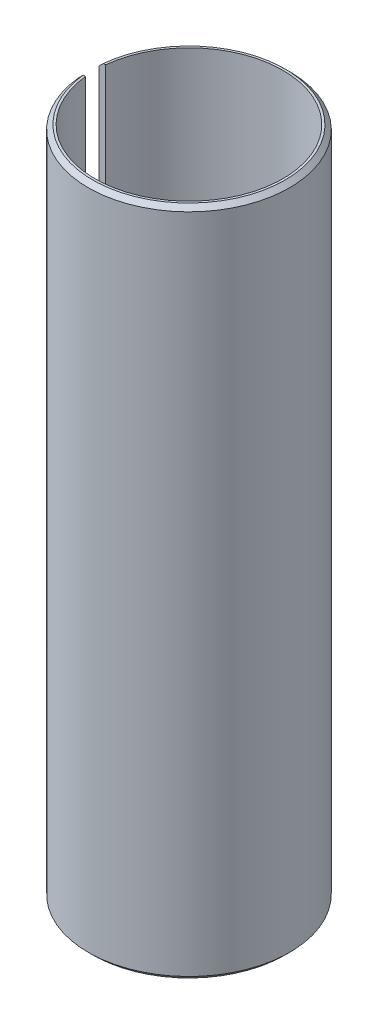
ISO-10303-21;
HEADER;
FILE_DESCRIPTION(('STEP AP214'),'2;1');
FILE_NAME('part.step','',(''),(''),'','','');
FILE_SCHEMA(('AUTOMOTIVE_DESIGN { 1 0 10303 214 1 1 1 1 }'));
ENDSEC;
DATA;
#1=APPLICATION_CONTEXT('core data for automotive mechanical design processes');
#2=APPLICATION_PROTOCOL_DEFINITION('international standard','automotive_design',2000,#1);
#3=PRODUCT_CONTEXT('',#1,'mechanical');
#4=PRODUCT('Part','Part','',(#3));
#5=PRODUCT_RELATED_PRODUCT_CATEGORY('part','',(#4));
#6=PRODUCT_DEFINITION_FORMATION('','',#4);
#7=PRODUCT_DEFINITION_CONTEXT('part definition',#1,'design');
#8=PRODUCT_DEFINITION('design','',#6,#7);
#9=PRODUCT_DEFINITION_SHAPE('','',#8);
#10=(LENGTH_UNIT() NAMED_UNIT(*) SI_UNIT(.MILLI.,.METRE.));
#11=(NAMED_UNIT(*) PLANE_ANGLE_UNIT() SI_UNIT($,.RADIAN.));
#12=(NAMED_UNIT(*) SI_UNIT($,.STERADIAN.) SOLID_ANGLE_UNIT());
#13=UNCERTAINTY_MEASURE_WITH_UNIT(LENGTH_MEASURE(1.E-05),#10,'distance_accuracy_value','');
#14=(GEOMETRIC_REPRESENTATION_CONTEXT(3) GLOBAL_UNCERTAINTY_ASSIGNED_CONTEXT((#13)) GLOBAL_UNIT_ASSIGNED_CONTEXT((#10,
#11,#12)) REPRESENTATION_CONTEXT('',''));
#15=CARTESIAN_POINT('',(0.,0.,0.));
#16=DIRECTION('',(0.,0.,1.));
#17=DIRECTION('',(1.,0.,0.));
#18=AXIS2_PLACEMENT_3D('',#15,#16,#17);
#19=CARTESIAN_POINT('',(2.8,10.,0.));
#20=DIRECTION('',(0.,-1.,0.));
#21=DIRECTION('',(0.,0.,-1.));
#22=AXIS2_PLACEMENT_3D('',#19,#20,#21);
#23=PLANE('',#22);
#24=CARTESIAN_POINT('',(0.,10.,0.));
#25=DIRECTION('',(0.,-1.,0.));
#26=DIRECTION('',(0.,0.,-1.));
#27=AXIS2_PLACEMENT_3D('',#24,#25,#26);
#28=CIRCLE('',#27,2.86666666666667);
#29=CARTESIAN_POINT('',(-2.85092577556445,10.,0.3));
#30=VERTEX_POINT('',#29);
#31=CARTESIAN_POINT('',(-2.85092577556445,10.,-0.3));
#32=VERTEX_POINT('',#31);
#33=EDGE_CURVE('E109',#30,#32,#28,.F.);
#34=ORIENTED_EDGE('',*,*,#33,.T.);
#35=DIRECTION('',(-1.,0.,0.));
#36=VECTOR('',#35,1.);
#37=CARTESIAN_POINT('',(0.,10.,-0.3));
#38=LINE('',#37,#36);
#39=CARTESIAN_POINT('',(-2.78388218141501,10.,-0.3));
#40=VERTEX_POINT('',#39);
#41=EDGE_CURVE('E161',#40,#32,#38,.T.);
#42=ORIENTED_EDGE('',*,*,#41,.F.);
#43=CARTESIAN_POINT('',(0.,10.,0.));
#44=DIRECTION('',(0.,1.,0.));
#45=DIRECTION('',(0.,0.,1.));
#46=AXIS2_PLACEMENT_3D('',#43,#44,#45);
#47=CIRCLE('',#46,2.8);
#48=CARTESIAN_POINT('',(-2.78388218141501,10.,0.3));
#49=VERTEX_POINT('',#48);
#50=EDGE_CURVE('E105',#49,#40,#47,.T.);
#51=ORIENTED_EDGE('',*,*,#50,.F.);
#52=DIRECTION('',(1.,0.,0.));
#53=VECTOR('',#52,1.);
#54=CARTESIAN_POINT('',(0.,10.,0.3));
#55=LINE('',#54,#53);
#56=EDGE_CURVE('E96',#30,#49,#55,.T.);
#57=ORIENTED_EDGE('',*,*,#56,.F.);
#58=EDGE_LOOP('',(#34,#42,#51,#57));
#59=FACE_BOUND('',#58,.T.);
#60=ADVANCED_FACE('F33',(#59),#23,.F.);
#61=CARTESIAN_POINT('',(0.,10.,0.));
#62=DIRECTION('',(0.,1.,0.));
#63=DIRECTION('',(0.,0.,1.));
#64=AXIS2_PLACEMENT_3D('',#61,#62,#63);
#65=CYLINDRICAL_SURFACE('',#64,3.);
#66=CARTESIAN_POINT('',(0.,-9.86666666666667,0.));
#67=DIRECTION('',(0.,1.,0.));
#68=DIRECTION('',(0.,0.,1.));
#69=AXIS2_PLACEMENT_3D('',#66,#67,#68);
#70=CIRCLE('',#69,3.);
#71=CARTESIAN_POINT('',(-2.98496231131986,-9.86666666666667,0.3));
#72=VERTEX_POINT('',#71);
#73=CARTESIAN_POINT('',(-2.98496231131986,-9.86666666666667,-0.3));
#74=VERTEX_POINT('',#73);
#75=EDGE_CURVE('E112',#72,#74,#70,.T.);
#76=ORIENTED_EDGE('',*,*,#75,.T.);
#77=DIRECTION('',(0.,1.,0.));
#78=VECTOR('',#77,1.);
#79=CARTESIAN_POINT('',(-2.98496231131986,10.,-0.3));
#80=LINE('',#79,#78);
#81=CARTESIAN_POINT('',(-2.98496231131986,9.86666666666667,-0.3));
#82=VERTEX_POINT('',#81);
#83=EDGE_CURVE('E51',#74,#82,#80,.T.);
#84=ORIENTED_EDGE('',*,*,#83,.T.);
#85=CARTESIAN_POINT('',(0.,9.86666666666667,0.));
#86=DIRECTION('',(0.,-1.,0.));
#87=DIRECTION('',(0.,0.,-1.));
#88=AXIS2_PLACEMENT_3D('',#85,#86,#87);
#89=CIRCLE('',#88,3.);
#90=CARTESIAN_POINT('',(-2.98496231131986,9.86666666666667,0.3));
#91=VERTEX_POINT('',#90);
#92=EDGE_CURVE('E118',#82,#91,#89,.T.);
#93=ORIENTED_EDGE('',*,*,#92,.T.);
#94=DIRECTION('',(0.,1.,0.));
#95=VECTOR('',#94,1.);
#96=CARTESIAN_POINT('',(-2.98496231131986,10.,0.3));
#97=LINE('',#96,#95);
#98=EDGE_CURVE('E142',#91,#72,#97,.F.);
#99=ORIENTED_EDGE('',*,*,#98,.T.);
#100=EDGE_LOOP('',(#76,#84,#93,#99));
#101=FACE_BOUND('',#100,.T.);
#102=ADVANCED_FACE('F167',(#101),#65,.T.);
#103=CARTESIAN_POINT('',(3.,-10.,0.));
#104=DIRECTION('',(0.,1.,0.));
#105=DIRECTION('',(0.,0.,1.));
#106=AXIS2_PLACEMENT_3D('',#103,#104,#105);
#107=PLANE('',#106);
#108=CARTESIAN_POINT('',(0.,-10.,0.));
#109=DIRECTION('',(0.,1.,0.));
#110=DIRECTION('',(0.,0.,1.));
#111=AXIS2_PLACEMENT_3D('',#108,#109,#110);
#112=CIRCLE('',#111,2.8);
#113=CARTESIAN_POINT('',(-2.78388218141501,-10.,0.3));
#114=VERTEX_POINT('',#113);
#115=CARTESIAN_POINT('',(-2.78388218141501,-10.,-0.3));
#116=VERTEX_POINT('',#115);
#117=EDGE_CURVE('E103',#114,#116,#112,.T.);
#118=ORIENTED_EDGE('',*,*,#117,.T.);
#119=DIRECTION('',(-1.,0.,0.));
#120=VECTOR('',#119,1.);
#121=CARTESIAN_POINT('',(0.,-10.,-0.3));
#122=LINE('',#121,#120);
#123=CARTESIAN_POINT('',(-2.85092577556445,-10.,-0.3));
#124=VERTEX_POINT('',#123);
#125=EDGE_CURVE('E87',#116,#124,#122,.T.);
#126=ORIENTED_EDGE('',*,*,#125,.T.);
#127=CARTESIAN_POINT('',(0.,-10.,0.));
#128=DIRECTION('',(0.,1.,0.));
#129=DIRECTION('',(0.,0.,1.));
#130=AXIS2_PLACEMENT_3D('',#127,#128,#129);
#131=CIRCLE('',#130,2.86666666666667);
#132=CARTESIAN_POINT('',(-2.85092577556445,-10.,0.3));
#133=VERTEX_POINT('',#132);
#134=EDGE_CURVE('E121',#124,#133,#131,.F.);
#135=ORIENTED_EDGE('',*,*,#134,.T.);
#136=DIRECTION('',(1.,0.,0.));
#137=VECTOR('',#136,1.);
#138=CARTESIAN_POINT('',(0.,-10.,0.3));
#139=LINE('',#138,#137);
#140=EDGE_CURVE('E59',#133,#114,#139,.T.);
#141=ORIENTED_EDGE('',*,*,#140,.T.);
#142=EDGE_LOOP('',(#118,#126,#135,#141));
#143=FACE_BOUND('',#142,.T.);
#144=ADVANCED_FACE('F108',(#143),#107,.F.);
#145=CARTESIAN_POINT('',(0.,10.,0.));
#146=DIRECTION('',(0.,1.,0.));
#147=DIRECTION('',(0.,0.,1.));
#148=AXIS2_PLACEMENT_3D('',#145,#146,#147);
#149=CYLINDRICAL_SURFACE('',#148,2.8);
#150=ORIENTED_EDGE('',*,*,#50,.T.);
#151=DIRECTION('',(0.,1.,0.));
#152=VECTOR('',#151,1.);
#153=CARTESIAN_POINT('',(-2.78388218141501,10.,-0.3));
#154=LINE('',#153,#152);
#155=EDGE_CURVE('E90',#40,#116,#154,.F.);
#156=ORIENTED_EDGE('',*,*,#155,.T.);
#157=ORIENTED_EDGE('',*,*,#117,.F.);
#158=DIRECTION('',(0.,1.,0.));
#159=VECTOR('',#158,1.);
#160=CARTESIAN_POINT('',(-2.78388218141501,10.,0.3));
#161=LINE('',#160,#159);
#162=EDGE_CURVE('E141',#114,#49,#161,.T.);
#163=ORIENTED_EDGE('',*,*,#162,.T.);
#164=EDGE_LOOP('',(#150,#156,#157,#163));
#165=FACE_BOUND('',#164,.T.);
#166=ADVANCED_FACE('F101',(#165),#149,.F.);
#167=CARTESIAN_POINT('',(0.,10.,0.));
#168=DIRECTION('',(0.,-1.,0.));
#169=DIRECTION('',(0.,0.,-1.));
#170=AXIS2_PLACEMENT_3D('',#167,#168,#169);
#171=CONICAL_SURFACE('',#170,2.86666666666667,0.785398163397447);
#172=CARTESIAN_POINT('',(-0.42228895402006,12.3486628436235,-0.3));
#173=CARTESIAN_POINT('',(-0.441919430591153,12.3326487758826,-0.3));
#174=CARTESIAN_POINT('',(-0.461375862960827,12.3164251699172,-0.3));
#175=CARTESIAN_POINT('',(-0.500010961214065,12.2836541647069,-0.3));
#176=CARTESIAN_POINT('',(-0.519189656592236,12.2671068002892,-0.3));
#177=CARTESIAN_POINT('',(-0.576410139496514,12.2171260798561,-0.3));
#178=CARTESIAN_POINT('',(-0.614147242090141,12.1833450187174,-0.3));
#179=CARTESIAN_POINT('',(-0.689110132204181,12.1152479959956,-0.3));
#180=CARTESIAN_POINT('',(-0.726336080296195,12.0809322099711,-0.3));
#181=CARTESIAN_POINT('',(-0.800460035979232,12.0119419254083,-0.3));
#182=CARTESIAN_POINT('',(-0.837358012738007,11.9772673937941,-0.3));
#183=CARTESIAN_POINT('',(-0.954590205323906,11.8663928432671,-0.3));
#184=CARTESIAN_POINT('',(-1.0345040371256,11.7897491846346,-0.3));
#185=CARTESIAN_POINT('',(-1.193801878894,11.6359127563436,-0.3));
#186=CARTESIAN_POINT('',(-1.27318587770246,11.5587199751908,-0.3));
#187=CARTESIAN_POINT('',(-1.51088596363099,11.3266798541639,-0.3));
#188=CARTESIAN_POINT('',(-1.66875058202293,11.1713703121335,-0.3));
#189=CARTESIAN_POINT('',(-1.98409000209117,10.8601736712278,-0.3));
#190=CARTESIAN_POINT('',(-2.14156452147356,10.704286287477,-0.3));
#191=CARTESIAN_POINT('',(-2.45624930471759,10.3922494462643,-0.3));
#192=CARTESIAN_POINT('',(-2.61345957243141,10.2360999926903,-0.3));
#193=CARTESIAN_POINT('',(-2.96362304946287,9.88796979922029,-0.3));
#194=CARTESIAN_POINT('',(-3.15653859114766,9.69595120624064,-0.3));
#195=CARTESIAN_POINT('',(-3.54224247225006,9.31178418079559,-0.3));
#196=CARTESIAN_POINT('',(-3.73503081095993,9.11963574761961,-0.3));
#197=CARTESIAN_POINT('',(-4.12036705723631,8.7354188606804,-0.3));
#198=CARTESIAN_POINT('',(-4.31291503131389,8.54335047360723,-0.3));
#199=CARTESIAN_POINT('',(-4.69795458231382,8.15915946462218,-0.3));
#200=CARTESIAN_POINT('',(-4.89044615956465,7.96703684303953,-0.3));
#201=CARTESIAN_POINT('',(-5.08292236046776,7.7748988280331,-0.3));
#202=B_SPLINE_CURVE_WITH_KNOTS('',3,(#172,#173,#174,#175,#176,#177,#178,#179,#180,#181,#182,
#183,#184,#185,#186,#187,#188,#189,#190,#191,#192,#193,#194,#195,#196,#197,#198,#199,#200,#201),
.UNSPECIFIED.,.F.,.F.,(4,2,2,2,2,2,2,2,2,2,2,2,2,2,4),(0.,0.0759967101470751,0.151985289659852,
0.30391986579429,0.455805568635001,0.607705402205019,0.939879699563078,1.27206097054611,
1.93642167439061,2.60117129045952,3.26591113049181,4.08248191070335,4.89905719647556,
5.71495233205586,6.53084261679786),.UNSPECIFIED.);
#203=EDGE_CURVE('E106',#32,#82,#202,.T.);
#204=ORIENTED_EDGE('',*,*,#203,.F.);
#205=ORIENTED_EDGE('',*,*,#33,.F.);
#206=CARTESIAN_POINT('',(-5.08292236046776,7.7748988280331,0.3));
#207=CARTESIAN_POINT('',(-4.89035715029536,7.96712555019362,0.3));
#208=CARTESIAN_POINT('',(-4.69777665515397,8.15933697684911,0.3));
#209=CARTESIAN_POINT('',(-4.3125646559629,8.54370009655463,0.3));
#210=CARTESIAN_POINT('',(-4.11993315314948,8.73585179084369,0.3));
#211=CARTESIAN_POINT('',(-3.7346019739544,9.12006305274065,0.3));
#212=CARTESIAN_POINT('',(-3.54190230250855,9.31212262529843,0.3));
#213=CARTESIAN_POINT('',(-3.15637139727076,9.69611810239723,0.3));
#214=CARTESIAN_POINT('',(-2.96354016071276,9.88805400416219,0.3));
#215=CARTESIAN_POINT('',(-2.67411138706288,10.1757994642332,0.3));
#216=CARTESIAN_POINT('',(-2.57759866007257,10.2716943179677,0.3));
#217=CARTESIAN_POINT('',(-2.3844941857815,10.4634027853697,0.3));
#218=CARTESIAN_POINT('',(-2.28790243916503,10.5592163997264,0.3));
#219=CARTESIAN_POINT('',(-2.09461098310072,10.7507218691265,0.3));
#220=CARTESIAN_POINT('',(-1.99791128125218,10.8464137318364,0.3));
#221=CARTESIAN_POINT('',(-1.80433481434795,11.0376241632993,0.3));
#222=CARTESIAN_POINT('',(-1.70745804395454,11.1331427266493,0.3));
#223=CARTESIAN_POINT('',(-1.51340424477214,11.3239192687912,0.3));
#224=CARTESIAN_POINT('',(-1.4162271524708,11.4191771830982,0.3));
#225=CARTESIAN_POINT('',(-1.2700887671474,11.5616717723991,0.3));
#226=CARTESIAN_POINT('',(-1.22131640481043,11.6091021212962,0.3));
#227=CARTESIAN_POINT('',(-1.12359047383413,11.70377913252,0.3));
#228=CARTESIAN_POINT('',(-1.07463689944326,11.7510257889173,0.3));
#229=CARTESIAN_POINT('',(-0.976450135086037,11.8452633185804,0.3));
#230=CARTESIAN_POINT('',(-0.927216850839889,11.8922540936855,0.3));
#231=CARTESIAN_POINT('',(-0.828353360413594,11.9858092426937,0.3));
#232=CARTESIAN_POINT('',(-0.778723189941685,12.0323736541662,0.3));
#233=CARTESIAN_POINT('',(-0.703764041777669,12.1016864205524,0.3));
#234=CARTESIAN_POINT('',(-0.678686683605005,12.1247064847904,0.3));
#235=CARTESIAN_POINT('',(-0.628304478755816,12.1704940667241,0.3));
#236=CARTESIAN_POINT('',(-0.602999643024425,12.1932615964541,0.3));
#237=CARTESIAN_POINT('',(-0.552074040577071,12.2384591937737,0.3));
#238=CARTESIAN_POINT('',(-0.526453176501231,12.2608891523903,0.3));
#239=CARTESIAN_POINT('',(-0.474751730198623,12.3052204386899,0.3));
#240=CARTESIAN_POINT('',(-0.448671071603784,12.327121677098,0.3));
#241=CARTESIAN_POINT('',(-0.42228895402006,12.3486628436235,0.3));
#242=B_SPLINE_CURVE_WITH_KNOTS('',3,(#206,#207,#208,#209,#210,#211,#212,#213,#214,#215,#216,
#217,#218,#219,#220,#221,#222,#223,#224,#225,#226,#227,#228,#229,#230,#231,#232,#233,#234,#235,
#236,#237,#238,#239,#240,#241),.UNSPECIFIED.,.F.,.F.,(4,2,2,2,2,2,2,2,2,2,2,2,2,2,2,2,2,4),(0.,
0.816267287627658,1.63251633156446,2.4487150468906,3.26493148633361,3.67309167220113,
4.0812483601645,4.48937793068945,4.89752001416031,5.30575529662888,5.50985161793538,
5.71395447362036,5.9181307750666,6.1222889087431,6.22441092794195,6.32652805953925,
6.4286774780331,6.53084402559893),.UNSPECIFIED.);
#243=EDGE_CURVE('E135',#91,#30,#242,.T.);
#244=ORIENTED_EDGE('',*,*,#243,.F.);
#245=ORIENTED_EDGE('',*,*,#92,.F.);
#246=EDGE_LOOP('',(#204,#205,#244,#245));
#247=FACE_BOUND('',#246,.T.);
#248=ADVANCED_FACE('F145',(#247),#171,.T.);
#249=CARTESIAN_POINT('',(0.,-9.86666666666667,0.));
#250=DIRECTION('',(0.,1.,0.));
#251=DIRECTION('',(0.,0.,1.));
#252=AXIS2_PLACEMENT_3D('',#249,#250,#251);
#253=CONICAL_SURFACE('',#252,3.,0.78539816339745);
#254=CARTESIAN_POINT('',(-5.08292236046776,-7.77489882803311,-0.3));
#255=CARTESIAN_POINT('',(-4.89035715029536,-7.96712555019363,-0.3));
#256=CARTESIAN_POINT('',(-4.69777665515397,-8.15933697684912,-0.3));
#257=CARTESIAN_POINT('',(-4.3125646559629,-8.54370009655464,-0.3));
#258=CARTESIAN_POINT('',(-4.11993315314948,-8.73585179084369,-0.3));
#259=CARTESIAN_POINT('',(-3.7346019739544,-9.12006305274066,-0.3));
#260=CARTESIAN_POINT('',(-3.54190230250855,-9.31212262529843,-0.3));
#261=CARTESIAN_POINT('',(-3.15637139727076,-9.69611810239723,-0.3));
#262=CARTESIAN_POINT('',(-2.96354016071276,-9.88805400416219,-0.3));
#263=CARTESIAN_POINT('',(-2.67411138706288,-10.1757994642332,-0.3));
#264=CARTESIAN_POINT('',(-2.57759866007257,-10.2716943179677,-0.3));
#265=CARTESIAN_POINT('',(-2.38449418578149,-10.4634027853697,-0.3));
#266=CARTESIAN_POINT('',(-2.28790243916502,-10.5592163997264,-0.3));
#267=CARTESIAN_POINT('',(-2.09461098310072,-10.7507218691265,-0.3));
#268=CARTESIAN_POINT('',(-1.99791128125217,-10.8464137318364,-0.3));
#269=CARTESIAN_POINT('',(-1.80433481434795,-11.0376241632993,-0.3));
#270=CARTESIAN_POINT('',(-1.70745804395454,-11.1331427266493,-0.3));
#271=CARTESIAN_POINT('',(-1.51340424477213,-11.3239192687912,-0.3));
#272=CARTESIAN_POINT('',(-1.4162271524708,-11.4191771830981,-0.3));
#273=CARTESIAN_POINT('',(-1.2700887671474,-11.5616717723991,-0.3));
#274=CARTESIAN_POINT('',(-1.22131640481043,-11.6091021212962,-0.3));
#275=CARTESIAN_POINT('',(-1.12359047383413,-11.70377913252,-0.3));
#276=CARTESIAN_POINT('',(-1.07463689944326,-11.7510257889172,-0.3));
#277=CARTESIAN_POINT('',(-0.976450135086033,-11.8452633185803,-0.3));
#278=CARTESIAN_POINT('',(-0.927216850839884,-11.8922540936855,-0.3));
#279=CARTESIAN_POINT('',(-0.828353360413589,-11.9858092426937,-0.3));
#280=CARTESIAN_POINT('',(-0.778723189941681,-12.0323736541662,-0.3));
#281=CARTESIAN_POINT('',(-0.703764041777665,-12.1016864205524,-0.3));
#282=CARTESIAN_POINT('',(-0.678686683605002,-12.1247064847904,-0.3));
#283=CARTESIAN_POINT('',(-0.628304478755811,-12.1704940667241,-0.3));
#284=CARTESIAN_POINT('',(-0.60299964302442,-12.1932615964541,-0.3));
#285=CARTESIAN_POINT('',(-0.552074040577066,-12.2384591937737,-0.3));
#286=CARTESIAN_POINT('',(-0.526453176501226,-12.2608891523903,-0.3));
#287=CARTESIAN_POINT('',(-0.474751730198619,-12.3052204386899,-0.3));
#288=CARTESIAN_POINT('',(-0.44867107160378,-12.327121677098,-0.3));
#289=CARTESIAN_POINT('',(-0.422288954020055,-12.3486628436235,-0.3));
#290=B_SPLINE_CURVE_WITH_KNOTS('',3,(#254,#255,#256,#257,#258,#259,#260,#261,#262,#263,#264,
#265,#266,#267,#268,#269,#270,#271,#272,#273,#274,#275,#276,#277,#278,#279,#280,#281,#282,#283,
#284,#285,#286,#287,#288,#289),.UNSPECIFIED.,.F.,.F.,(4,2,2,2,2,2,2,2,2,2,2,2,2,2,2,2,2,4),(0.,
0.816267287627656,1.63251633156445,2.4487150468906,3.2649314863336,3.67309167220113,
4.08124836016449,4.48937793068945,4.8975200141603,5.30575529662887,5.50985161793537,
5.71395447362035,5.91813077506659,6.12228890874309,6.22441092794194,6.32652805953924,
6.42867747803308,6.53084402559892),.UNSPECIFIED.);
#291=EDGE_CURVE('E11',#74,#124,#290,.T.);
#292=ORIENTED_EDGE('',*,*,#291,.F.);
#293=ORIENTED_EDGE('',*,*,#75,.F.);
#294=CARTESIAN_POINT('',(-0.422288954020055,-12.3486628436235,0.3));
#295=CARTESIAN_POINT('',(-0.441919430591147,-12.3326487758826,0.3));
#296=CARTESIAN_POINT('',(-0.461375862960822,-12.3164251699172,0.3));
#297=CARTESIAN_POINT('',(-0.500010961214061,-12.2836541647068,0.3));
#298=CARTESIAN_POINT('',(-0.519189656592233,-12.2671068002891,0.3));
#299=CARTESIAN_POINT('',(-0.576410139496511,-12.2171260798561,0.3));
#300=CARTESIAN_POINT('',(-0.614147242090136,-12.1833450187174,0.3));
#301=CARTESIAN_POINT('',(-0.689110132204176,-12.1152479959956,0.3));
#302=CARTESIAN_POINT('',(-0.726336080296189,-12.0809322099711,0.3));
#303=CARTESIAN_POINT('',(-0.800460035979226,-12.0119419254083,0.3));
#304=CARTESIAN_POINT('',(-0.837358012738,-11.9772673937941,0.3));
#305=CARTESIAN_POINT('',(-0.954590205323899,-11.8663928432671,0.3));
#306=CARTESIAN_POINT('',(-1.0345040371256,-11.7897491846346,0.3));
#307=CARTESIAN_POINT('',(-1.19380187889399,-11.6359127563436,0.3));
#308=CARTESIAN_POINT('',(-1.27318587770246,-11.5587199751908,0.3));
#309=CARTESIAN_POINT('',(-1.51088596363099,-11.3266798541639,0.3));
#310=CARTESIAN_POINT('',(-1.66875058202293,-11.1713703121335,0.3));
#311=CARTESIAN_POINT('',(-1.98409000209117,-10.8601736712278,0.3));
#312=CARTESIAN_POINT('',(-2.14156452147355,-10.704286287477,0.3));
#313=CARTESIAN_POINT('',(-2.45624930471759,-10.3922494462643,0.3));
#314=CARTESIAN_POINT('',(-2.61345957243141,-10.2360999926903,0.3));
#315=CARTESIAN_POINT('',(-2.96362304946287,-9.88796979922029,0.3));
#316=CARTESIAN_POINT('',(-3.15653859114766,-9.69595120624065,0.3));
#317=CARTESIAN_POINT('',(-3.54224247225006,-9.31178418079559,0.3));
#318=CARTESIAN_POINT('',(-3.73503081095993,-9.11963574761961,0.3));
#319=CARTESIAN_POINT('',(-4.12036705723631,-8.73541886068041,0.3));
#320=CARTESIAN_POINT('',(-4.31291503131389,-8.54335047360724,0.3));
#321=CARTESIAN_POINT('',(-4.69795458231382,-8.15915946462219,0.3));
#322=CARTESIAN_POINT('',(-4.89044615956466,-7.96703684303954,0.3));
#323=CARTESIAN_POINT('',(-5.08292236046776,-7.77489882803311,0.3));
#324=B_SPLINE_CURVE_WITH_KNOTS('',3,(#294,#295,#296,#297,#298,#299,#300,#301,#302,#303,#304,
#305,#306,#307,#308,#309,#310,#311,#312,#313,#314,#315,#316,#317,#318,#319,#320,#321,#322,#323),
.UNSPECIFIED.,.F.,.F.,(4,2,2,2,2,2,2,2,2,2,2,2,2,2,4),(0.,0.0759967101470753,0.151985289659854,
0.303919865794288,0.455805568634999,0.607705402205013,0.939879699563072,1.2720609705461,
1.9364216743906,2.60117129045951,3.2659111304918,4.08248191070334,4.89905719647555,
5.71495233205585,6.53084261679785),.UNSPECIFIED.);
#325=EDGE_CURVE('E45',#133,#72,#324,.T.);
#326=ORIENTED_EDGE('',*,*,#325,.F.);
#327=ORIENTED_EDGE('',*,*,#134,.F.);
#328=EDGE_LOOP('',(#292,#293,#326,#327));
#329=FACE_BOUND('',#328,.T.);
#330=ADVANCED_FACE('F126',(#329),#253,.T.);
#331=CARTESIAN_POINT('',(0.,-10.,0.3));
#332=DIRECTION('',(0.,0.,1.));
#333=DIRECTION('',(1.,0.,0.));
#334=AXIS2_PLACEMENT_3D('',#331,#332,#333);
#335=PLANE('',#334);
#336=ORIENTED_EDGE('',*,*,#140,.F.);
#337=ORIENTED_EDGE('',*,*,#325,.T.);
#338=ORIENTED_EDGE('',*,*,#98,.F.);
#339=ORIENTED_EDGE('',*,*,#243,.T.);
#340=ORIENTED_EDGE('',*,*,#56,.T.);
#341=ORIENTED_EDGE('',*,*,#162,.F.);
#342=EDGE_LOOP('',(#336,#337,#338,#339,#340,#341));
#343=FACE_BOUND('',#342,.T.);
#344=ADVANCED_FACE('F129',(#343),#335,.F.);
#345=CARTESIAN_POINT('',(0.,-10.,-0.3));
#346=DIRECTION('',(0.,0.,-1.));
#347=DIRECTION('',(-1.,0.,0.));
#348=AXIS2_PLACEMENT_3D('',#345,#346,#347);
#349=PLANE('',#348);
#350=ORIENTED_EDGE('',*,*,#41,.T.);
#351=ORIENTED_EDGE('',*,*,#203,.T.);
#352=ORIENTED_EDGE('',*,*,#83,.F.);
#353=ORIENTED_EDGE('',*,*,#291,.T.);
#354=ORIENTED_EDGE('',*,*,#125,.F.);
#355=ORIENTED_EDGE('',*,*,#155,.F.);
#356=EDGE_LOOP('',(#350,#351,#352,#353,#354,#355));
#357=FACE_BOUND('',#356,.T.);
#358=ADVANCED_FACE('F89',(#357),#349,.F.);
#359=CLOSED_SHELL('',(#60,#102,#144,#166,#248,#330,#344,#358));
#360=MANIFOLD_SOLID_BREP('B2',#359);
#361=ADVANCED_BREP_SHAPE_REPRESENTATION('',(#18,#360),#14);
#362=SHAPE_DEFINITION_REPRESENTATION(#9,#361);
ENDSEC;
END-ISO-10303-21;
